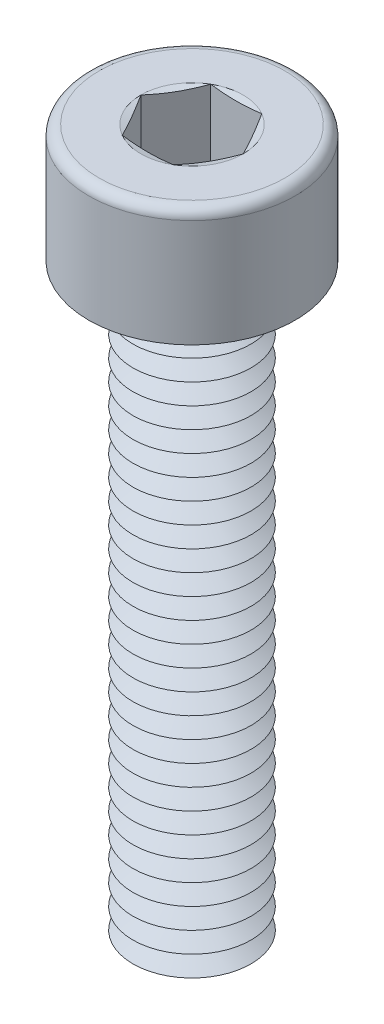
from build123d import *

# Parameters (mm, degrees)
SKETCH1_R       = 2
EXTRUDE1_DEPTH  = 20
SKETCH2_R       = 3.5
EXTRUDE2_DEPTH  = 4
EXTRUDE3_DEPTH  = 3
FILLET1_R       = 0.35
LPATTERN1_COUNT = 29
LPATTERN1_PITCH = 0.7


with BuildPart() as part:
    # Sketch1 → Extrude1 (new body)
    with BuildSketch(Plane(origin=(0, 0, 0), x_dir=(1, 0, 0), z_dir=(0, 1, 0))):
        with Locations(Location((0, 0, 0), (0, 0, 270))):
            Circle(SKETCH1_R)
    extrude(amount=EXTRUDE1_DEPTH)

    # Sketch2 → Extrude2 (add)
    with BuildSketch(Plane(origin=(0, 20, 0), x_dir=(1, 0, 0), z_dir=(0, 1, 0))):
        with Locations(Location((0, 0, 0), (0, 0, 270))):
            Circle(SKETCH2_R)
    extrude(amount=EXTRUDE2_DEPTH)

    # Sketch3 → Extrude3 (cut)
    with BuildSketch(Plane(origin=(0, 24, 0), x_dir=(1, 0, 0), z_dir=(0, 1, 0))):
        Polygon((0.866025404, 1.5), (-0.866025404, 1.5), (-1.732050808, 0), (-0.866025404, -1.5), (0.866025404, -1.5), (1.732050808, 0), align=None)
    extrude(amount=-EXTRUDE3_DEPTH, mode=Mode.SUBTRACT)

    # Fillet1
    fillet1_edges = [part.edges().sort_by_distance(p)[0] for p in [
        (0, 24, -3.5),
    ]]
    fillet(fillet1_edges, radius=FILLET1_R)

    # Sketch4 → Cut-Revolve1 (revolve, cut)
    with BuildSketch(Plane(origin=(0, 0, 0), x_dir=(0, 0, -1), z_dir=(1, 0, 0))):
        Polygon((-1.5, 21), (0, 21), (0, 20.133974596), align=None)
    revolve(axis=Axis((0, 21, 0), (0, -1, 0)), mode=Mode.SUBTRACT)

    # Sketch5 → Cut-Revolve2 (revolve, cut)
    with BuildSketch(Plane.XY, mode=Mode.PRIVATE) as cut_revolve2_sk:
        Polygon((-2, 0.35), (-2, -0.35), (-1.393782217, 0), align=None)
    cut_revolve2 = revolve(cut_revolve2_sk.sketch.rotate(Axis((0, 20, 0), (0, -1, 0)), 270), axis=Axis((0, 20, 0), (0, -1, 0)), mode=Mode.SUBTRACT)

    # LPattern1: Cut-Revolve2 ×29
    with Locations(*[(0, i * LPATTERN1_PITCH, 0) for i in range(1, LPATTERN1_COUNT)]):
        add(cut_revolve2, mode=Mode.SUBTRACT)

    # Extrude4 cone 1 section (on through the dimple's axis) → Extrude4 (revolve, cut)
    with BuildSketch(Plane(origin=(0, 24, 0), x_dir=(0, 0, 1), z_dir=(1, 0, 0))):
        Polygon((0, 0), (1.732050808, 0), (0, 0.464101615), align=None)
    revolve(axis=Axis((0, 24, 0), (0, -1, 0)), mode=Mode.SUBTRACT)


solid = part.part
